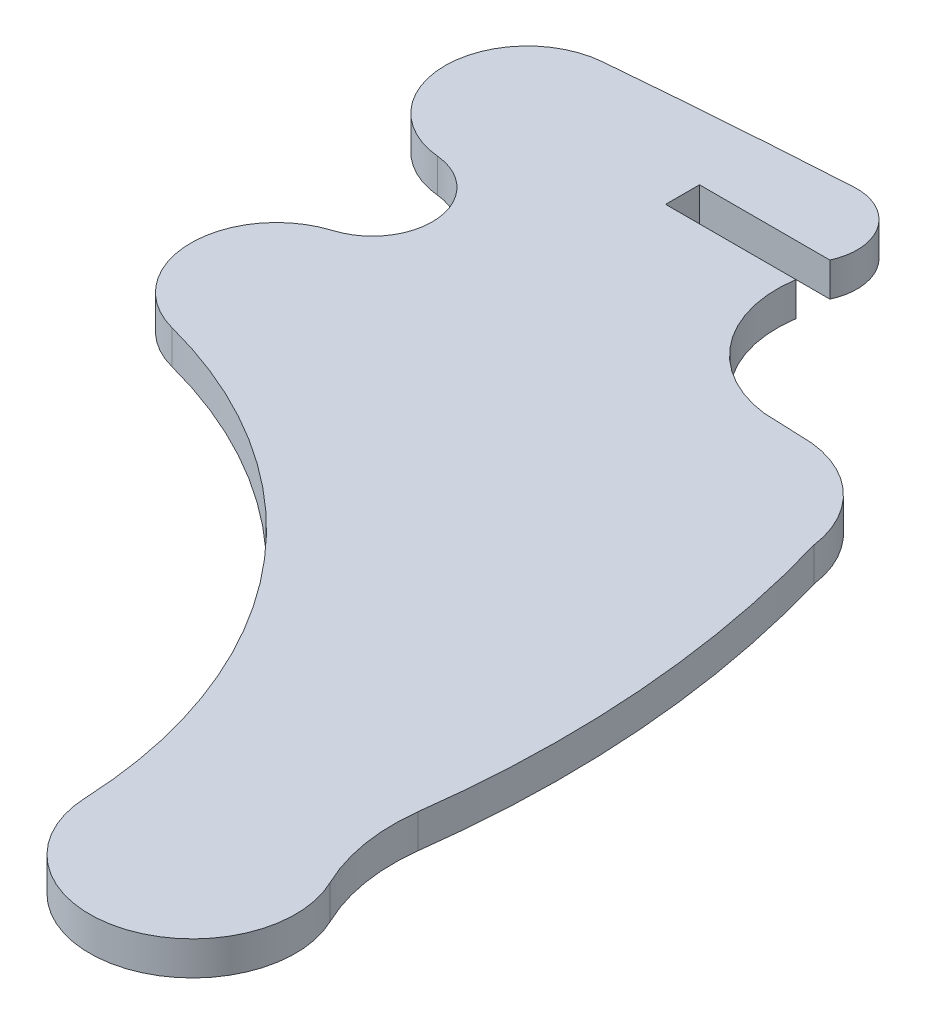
ISO-10303-21;
HEADER;
FILE_DESCRIPTION(('STEP AP214'),'2;1');
FILE_NAME('part.step','',(''),(''),'','','');
FILE_SCHEMA(('AUTOMOTIVE_DESIGN { 1 0 10303 214 1 1 1 1 }'));
ENDSEC;
DATA;
#1=APPLICATION_CONTEXT('core data for automotive mechanical design processes');
#2=APPLICATION_PROTOCOL_DEFINITION('international standard','automotive_design',2000,#1);
#3=PRODUCT_CONTEXT('',#1,'mechanical');
#4=PRODUCT('Part','Part','',(#3));
#5=PRODUCT_RELATED_PRODUCT_CATEGORY('part','',(#4));
#6=PRODUCT_DEFINITION_FORMATION('','',#4);
#7=PRODUCT_DEFINITION_CONTEXT('part definition',#1,'design');
#8=PRODUCT_DEFINITION('design','',#6,#7);
#9=PRODUCT_DEFINITION_SHAPE('','',#8);
#10=(LENGTH_UNIT() NAMED_UNIT(*) SI_UNIT(.MILLI.,.METRE.));
#11=(NAMED_UNIT(*) PLANE_ANGLE_UNIT() SI_UNIT($,.RADIAN.));
#12=(NAMED_UNIT(*) SI_UNIT($,.STERADIAN.) SOLID_ANGLE_UNIT());
#13=UNCERTAINTY_MEASURE_WITH_UNIT(LENGTH_MEASURE(1.E-05),#10,'distance_accuracy_value','');
#14=(GEOMETRIC_REPRESENTATION_CONTEXT(3) GLOBAL_UNCERTAINTY_ASSIGNED_CONTEXT((#13)) GLOBAL_UNIT_ASSIGNED_CONTEXT((#10,
#11,#12)) REPRESENTATION_CONTEXT('',''));
#15=CARTESIAN_POINT('',(0.,0.,0.));
#16=DIRECTION('',(0.,0.,1.));
#17=DIRECTION('',(1.,0.,0.));
#18=AXIS2_PLACEMENT_3D('',#15,#16,#17);
#19=CARTESIAN_POINT('',(-42007.813564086,3.,-18403.2242232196));
#20=DIRECTION('',(0.,-1.,0.));
#21=DIRECTION('',(0.,0.,-1.));
#22=AXIS2_PLACEMENT_3D('',#19,#20,#21);
#23=CYLINDRICAL_SURFACE('',#22,4.69313285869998);
#24=CARTESIAN_POINT('',(-42007.813564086,0.,-18403.2242232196));
#25=DIRECTION('',(0.,1.,0.));
#26=DIRECTION('',(0.,0.,1.));
#27=AXIS2_PLACEMENT_3D('',#24,#25,#26);
#28=CIRCLE('',#27,4.69313285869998);
#29=CARTESIAN_POINT('',(-42003.558594,0.,-18401.244141));
#30=VERTEX_POINT('',#29);
#31=CARTESIAN_POINT('',(-42008.085483,0.,-18407.9094719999));
#32=VERTEX_POINT('',#31);
#33=EDGE_CURVE('E174',#30,#32,#28,.T.);
#34=ORIENTED_EDGE('',*,*,#33,.T.);
#35=DIRECTION('',(0.,-1.,0.));
#36=VECTOR('',#35,1.);
#37=CARTESIAN_POINT('',(-42008.085483,3.,-18407.9094719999));
#38=LINE('',#37,#36);
#39=CARTESIAN_POINT('',(-42008.085483,3.,-18407.9094719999));
#40=VERTEX_POINT('',#39);
#41=EDGE_CURVE('E11',#40,#32,#38,.T.);
#42=ORIENTED_EDGE('',*,*,#41,.F.);
#43=CARTESIAN_POINT('',(-42007.813564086,3.,-18403.2242232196));
#44=DIRECTION('',(0.,1.,0.));
#45=DIRECTION('',(0.,0.,1.));
#46=AXIS2_PLACEMENT_3D('',#43,#44,#45);
#47=CIRCLE('',#46,4.69313285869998);
#48=CARTESIAN_POINT('',(-42003.558594,3.,-18401.244141));
#49=VERTEX_POINT('',#48);
#50=EDGE_CURVE('E202',#49,#40,#47,.T.);
#51=ORIENTED_EDGE('',*,*,#50,.F.);
#52=DIRECTION('',(0.,-1.,0.));
#53=VECTOR('',#52,1.);
#54=CARTESIAN_POINT('',(-42003.558594,3.,-18401.244141));
#55=LINE('',#54,#53);
#56=EDGE_CURVE('E170',#49,#30,#55,.T.);
#57=ORIENTED_EDGE('',*,*,#56,.T.);
#58=EDGE_LOOP('',(#34,#42,#51,#57));
#59=FACE_BOUND('',#58,.T.);
#60=ADVANCED_FACE('F36',(#59),#23,.T.);
#61=CARTESIAN_POINT('',(-41969.777339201,3.,-17743.9472663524));
#62=DIRECTION('',(0.,-1.,0.));
#63=DIRECTION('',(0.,0.,-1.));
#64=AXIS2_PLACEMENT_3D('',#61,#62,#63);
#65=CYLINDRICAL_SURFACE('',#64,665.066406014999);
#66=CARTESIAN_POINT('',(-41969.777339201,0.,-17743.9472663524));
#67=DIRECTION('',(0.,1.,0.));
#68=DIRECTION('',(0.,0.,1.));
#69=AXIS2_PLACEMENT_3D('',#66,#67,#68);
#70=CIRCLE('',#69,665.066406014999);
#71=CARTESIAN_POINT('',(-42028.8619710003,0.,-18406.383928));
#72=VERTEX_POINT('',#71);
#73=EDGE_CURVE('E177',#32,#72,#70,.T.);
#74=ORIENTED_EDGE('',*,*,#73,.T.);
#75=DIRECTION('',(0.,-1.,0.));
#76=VECTOR('',#75,1.);
#77=CARTESIAN_POINT('',(-42028.8619710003,3.,-18406.383928));
#78=LINE('',#77,#76);
#79=CARTESIAN_POINT('',(-42028.8619710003,3.,-18406.383928));
#80=VERTEX_POINT('',#79);
#81=EDGE_CURVE('E44',#80,#72,#78,.T.);
#82=ORIENTED_EDGE('',*,*,#81,.F.);
#83=CARTESIAN_POINT('',(-41969.777339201,3.,-17743.9472663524));
#84=DIRECTION('',(0.,1.,0.));
#85=DIRECTION('',(0.,0.,1.));
#86=AXIS2_PLACEMENT_3D('',#83,#84,#85);
#87=CIRCLE('',#86,665.066406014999);
#88=EDGE_CURVE('E116',#40,#80,#87,.T.);
#89=ORIENTED_EDGE('',*,*,#88,.F.);
#90=ORIENTED_EDGE('',*,*,#41,.T.);
#91=EDGE_LOOP('',(#74,#82,#89,#90));
#92=FACE_BOUND('',#91,.T.);
#93=ADVANCED_FACE('F295',(#92),#65,.T.);
#94=CARTESIAN_POINT('',(-42028.2148416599,3.,-18399.1082920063));
#95=DIRECTION('',(0.,-1.,0.));
#96=DIRECTION('',(0.,0.,-1.));
#97=AXIS2_PLACEMENT_3D('',#94,#95,#96);
#98=CYLINDRICAL_SURFACE('',#97,7.30435866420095);
#99=CARTESIAN_POINT('',(-42028.2148416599,0.,-18399.1082920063));
#100=DIRECTION('',(0.,1.,0.));
#101=DIRECTION('',(0.,0.,1.));
#102=AXIS2_PLACEMENT_3D('',#99,#100,#101);
#103=CIRCLE('',#102,7.30435866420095);
#104=CARTESIAN_POINT('',(-42028.9011059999,0.,-18391.836243));
#105=VERTEX_POINT('',#104);
#106=EDGE_CURVE('E179',#72,#105,#103,.T.);
#107=ORIENTED_EDGE('',*,*,#106,.T.);
#108=DIRECTION('',(0.,-1.,0.));
#109=VECTOR('',#108,1.);
#110=CARTESIAN_POINT('',(-42028.9011059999,3.,-18391.836243));
#111=LINE('',#110,#109);
#112=CARTESIAN_POINT('',(-42028.9011059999,3.,-18391.836243));
#113=VERTEX_POINT('',#112);
#114=EDGE_CURVE('E230',#113,#105,#111,.T.);
#115=ORIENTED_EDGE('',*,*,#114,.F.);
#116=CARTESIAN_POINT('',(-42028.2148416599,3.,-18399.1082920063));
#117=DIRECTION('',(0.,1.,0.));
#118=DIRECTION('',(0.,0.,1.));
#119=AXIS2_PLACEMENT_3D('',#116,#117,#118);
#120=CIRCLE('',#119,7.30435866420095);
#121=EDGE_CURVE('E238',#80,#113,#120,.T.);
#122=ORIENTED_EDGE('',*,*,#121,.F.);
#123=ORIENTED_EDGE('',*,*,#81,.T.);
#124=EDGE_LOOP('',(#107,#115,#122,#123));
#125=FACE_BOUND('',#124,.T.);
#126=ADVANCED_FACE('F236',(#125),#98,.T.);
#127=CARTESIAN_POINT('',(-42029.3984280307,3.,-18386.5585073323));
#128=DIRECTION('',(0.,-1.,0.));
#129=DIRECTION('',(0.,0.,-1.));
#130=AXIS2_PLACEMENT_3D('',#127,#128,#129);
#131=CYLINDRICAL_SURFACE('',#130,5.30111525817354);
#132=CARTESIAN_POINT('',(-42029.3984280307,0.,-18386.5585073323));
#133=DIRECTION('',(0.,-1.,0.));
#134=DIRECTION('',(0.,0.,1.));
#135=AXIS2_PLACEMENT_3D('',#132,#133,#134);
#136=CIRCLE('',#135,5.30111525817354);
#137=CARTESIAN_POINT('',(-42027.830825,0.,-18381.494473));
#138=VERTEX_POINT('',#137);
#139=EDGE_CURVE('E181',#105,#138,#136,.T.);
#140=ORIENTED_EDGE('',*,*,#139,.T.);
#141=DIRECTION('',(0.,-1.,0.));
#142=VECTOR('',#141,1.);
#143=CARTESIAN_POINT('',(-42027.830825,3.,-18381.494473));
#144=LINE('',#143,#142);
#145=CARTESIAN_POINT('',(-42027.830825,3.,-18381.494473));
#146=VERTEX_POINT('',#145);
#147=EDGE_CURVE('E227',#146,#138,#144,.T.);
#148=ORIENTED_EDGE('',*,*,#147,.F.);
#149=CARTESIAN_POINT('',(-42029.3984280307,3.,-18386.5585073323));
#150=DIRECTION('',(0.,-1.,0.));
#151=DIRECTION('',(0.,0.,1.));
#152=AXIS2_PLACEMENT_3D('',#149,#150,#151);
#153=CIRCLE('',#152,5.30111525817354);
#154=EDGE_CURVE('E256',#113,#146,#153,.T.);
#155=ORIENTED_EDGE('',*,*,#154,.F.);
#156=ORIENTED_EDGE('',*,*,#114,.T.);
#157=EDGE_LOOP('',(#140,#148,#155,#156));
#158=FACE_BOUND('',#157,.T.);
#159=ADVANCED_FACE('F247',(#158),#131,.F.);
#160=CARTESIAN_POINT('',(-42025.5898252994,3.,-18374.2511101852));
#161=DIRECTION('',(0.,-1.,0.));
#162=DIRECTION('',(0.,0.,-1.));
#163=AXIS2_PLACEMENT_3D('',#160,#161,#162);
#164=CYLINDRICAL_SURFACE('',#163,7.5821095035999);
#165=CARTESIAN_POINT('',(-42025.5898252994,0.,-18374.2511101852));
#166=DIRECTION('',(0.,1.,0.));
#167=DIRECTION('',(0.,0.,1.));
#168=AXIS2_PLACEMENT_3D('',#165,#166,#167);
#169=CIRCLE('',#168,7.5821095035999);
#170=CARTESIAN_POINT('',(-42027.507342,0.,-18366.915477));
#171=VERTEX_POINT('',#170);
#172=EDGE_CURVE('E183',#138,#171,#169,.T.);
#173=ORIENTED_EDGE('',*,*,#172,.T.);
#174=DIRECTION('',(0.,-1.,0.));
#175=VECTOR('',#174,1.);
#176=CARTESIAN_POINT('',(-42027.507342,3.,-18366.915477));
#177=LINE('',#176,#175);
#178=CARTESIAN_POINT('',(-42027.507342,3.,-18366.915477));
#179=VERTEX_POINT('',#178);
#180=EDGE_CURVE('E224',#179,#171,#177,.T.);
#181=ORIENTED_EDGE('',*,*,#180,.F.);
#182=CARTESIAN_POINT('',(-42025.5898252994,3.,-18374.2511101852));
#183=DIRECTION('',(0.,1.,0.));
#184=DIRECTION('',(0.,0.,1.));
#185=AXIS2_PLACEMENT_3D('',#182,#183,#184);
#186=CIRCLE('',#185,7.5821095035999);
#187=EDGE_CURVE('E253',#146,#179,#186,.T.);
#188=ORIENTED_EDGE('',*,*,#187,.F.);
#189=ORIENTED_EDGE('',*,*,#147,.T.);
#190=EDGE_LOOP('',(#173,#181,#188,#189));
#191=FACE_BOUND('',#190,.T.);
#192=ADVANCED_FACE('F251',(#191),#164,.T.);
#193=CARTESIAN_POINT('',(-42038.4345437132,3.,-18325.114457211));
#194=DIRECTION('',(0.,-1.,0.));
#195=DIRECTION('',(0.,0.,-1.));
#196=AXIS2_PLACEMENT_3D('',#193,#194,#195);
#197=CYLINDRICAL_SURFACE('',#196,43.2056592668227);
#198=CARTESIAN_POINT('',(-42038.4345437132,0.,-18325.114457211));
#199=DIRECTION('',(0.,-1.,0.));
#200=DIRECTION('',(0.,0.,1.));
#201=AXIS2_PLACEMENT_3D('',#198,#199,#200);
#202=CIRCLE('',#201,43.2056592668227);
#203=CARTESIAN_POINT('',(-41995.269582,0.,-18326.98931));
#204=VERTEX_POINT('',#203);
#205=EDGE_CURVE('E185',#171,#204,#202,.T.);
#206=ORIENTED_EDGE('',*,*,#205,.T.);
#207=DIRECTION('',(0.,-1.,0.));
#208=VECTOR('',#207,1.);
#209=CARTESIAN_POINT('',(-41995.269582,3.,-18326.98931));
#210=LINE('',#209,#208);
#211=CARTESIAN_POINT('',(-41995.269582,3.,-18326.98931));
#212=VERTEX_POINT('',#211);
#213=EDGE_CURVE('E221',#212,#204,#210,.T.);
#214=ORIENTED_EDGE('',*,*,#213,.F.);
#215=CARTESIAN_POINT('',(-42038.4345437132,3.,-18325.114457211));
#216=DIRECTION('',(0.,-1.,0.));
#217=DIRECTION('',(0.,0.,1.));
#218=AXIS2_PLACEMENT_3D('',#215,#216,#217);
#219=CIRCLE('',#218,43.2056592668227);
#220=EDGE_CURVE('E255',#179,#212,#219,.T.);
#221=ORIENTED_EDGE('',*,*,#220,.F.);
#222=ORIENTED_EDGE('',*,*,#180,.T.);
#223=EDGE_LOOP('',(#206,#214,#221,#222));
#224=FACE_BOUND('',#223,.T.);
#225=ADVANCED_FACE('F308',(#224),#197,.F.);
#226=CARTESIAN_POINT('',(-41986.1528680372,3.,-18327.3865868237));
#227=DIRECTION('',(0.,-1.,0.));
#228=DIRECTION('',(0.,0.,-1.));
#229=AXIS2_PLACEMENT_3D('',#226,#227,#228);
#230=CYLINDRICAL_SURFACE('',#229,9.12536587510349);
#231=CARTESIAN_POINT('',(-41986.1528680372,0.,-18327.3865868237));
#232=DIRECTION('',(0.,1.,0.));
#233=DIRECTION('',(0.,0.,1.));
#234=AXIS2_PLACEMENT_3D('',#231,#232,#233);
#235=CIRCLE('',#234,9.12536587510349);
#236=CARTESIAN_POINT('',(-41977.938337,0.,-18331.3607259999));
#237=VERTEX_POINT('',#236);
#238=EDGE_CURVE('E187',#204,#237,#235,.T.);
#239=ORIENTED_EDGE('',*,*,#238,.T.);
#240=DIRECTION('',(0.,-1.,0.));
#241=VECTOR('',#240,1.);
#242=CARTESIAN_POINT('',(-41977.938337,3.,-18331.3607259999));
#243=LINE('',#242,#241);
#244=CARTESIAN_POINT('',(-41977.938337,3.,-18331.3607259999));
#245=VERTEX_POINT('',#244);
#246=EDGE_CURVE('E218',#245,#237,#243,.T.);
#247=ORIENTED_EDGE('',*,*,#246,.F.);
#248=CARTESIAN_POINT('',(-41986.1528680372,3.,-18327.3865868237));
#249=DIRECTION('',(0.,1.,0.));
#250=DIRECTION('',(0.,0.,1.));
#251=AXIS2_PLACEMENT_3D('',#248,#249,#250);
#252=CIRCLE('',#251,9.12536587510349);
#253=EDGE_CURVE('E258',#212,#245,#252,.T.);
#254=ORIENTED_EDGE('',*,*,#253,.F.);
#255=ORIENTED_EDGE('',*,*,#213,.T.);
#256=EDGE_LOOP('',(#239,#247,#254,#255));
#257=FACE_BOUND('',#256,.T.);
#258=ADVANCED_FACE('F311',(#257),#230,.T.);
#259=CARTESIAN_POINT('',(-41962.9175374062,3.,-18338.6223828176));
#260=DIRECTION('',(0.,-1.,0.));
#261=DIRECTION('',(0.,0.,-1.));
#262=AXIS2_PLACEMENT_3D('',#259,#260,#261);
#263=CYLINDRICAL_SURFACE('',#262,16.6840067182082);
#264=CARTESIAN_POINT('',(-41962.9175374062,0.,-18338.6223828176));
#265=DIRECTION('',(0.,-1.,0.));
#266=DIRECTION('',(0.,0.,1.));
#267=AXIS2_PLACEMENT_3D('',#264,#265,#266);
#268=CIRCLE('',#267,16.6840067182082);
#269=CARTESIAN_POINT('',(-41979.474598,0.,-18340.676604));
#270=VERTEX_POINT('',#269);
#271=EDGE_CURVE('E189',#237,#270,#268,.T.);
#272=ORIENTED_EDGE('',*,*,#271,.T.);
#273=DIRECTION('',(0.,-1.,0.));
#274=VECTOR('',#273,1.);
#275=CARTESIAN_POINT('',(-41979.474598,3.,-18340.676604));
#276=LINE('',#275,#274);
#277=CARTESIAN_POINT('',(-41979.474598,3.,-18340.676604));
#278=VERTEX_POINT('',#277);
#279=EDGE_CURVE('E215',#278,#270,#276,.T.);
#280=ORIENTED_EDGE('',*,*,#279,.F.);
#281=CARTESIAN_POINT('',(-41962.9175374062,3.,-18338.6223828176));
#282=DIRECTION('',(0.,-1.,0.));
#283=DIRECTION('',(0.,0.,1.));
#284=AXIS2_PLACEMENT_3D('',#281,#282,#283);
#285=CIRCLE('',#284,16.6840067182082);
#286=EDGE_CURVE('E264',#245,#278,#285,.T.);
#287=ORIENTED_EDGE('',*,*,#286,.F.);
#288=ORIENTED_EDGE('',*,*,#246,.T.);
#289=EDGE_LOOP('',(#272,#280,#287,#288));
#290=FACE_BOUND('',#289,.T.);
#291=ADVANCED_FACE('F315',(#290),#263,.F.);
#292=CARTESIAN_POINT('',(-42071.0276520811,3.,-18352.742278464));
#293=DIRECTION('',(0.,-1.,0.));
#294=DIRECTION('',(0.,0.,-1.));
#295=AXIS2_PLACEMENT_3D('',#292,#293,#294);
#296=CYLINDRICAL_SURFACE('',#295,92.3446923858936);
#297=CARTESIAN_POINT('',(-42071.0276520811,0.,-18352.742278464));
#298=DIRECTION('',(0.,1.,0.));
#299=DIRECTION('',(0.,0.,1.));
#300=AXIS2_PLACEMENT_3D('',#297,#298,#299);
#301=CIRCLE('',#300,92.3446923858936);
#302=CARTESIAN_POINT('',(-41982.404563,0.,-18378.69397));
#303=VERTEX_POINT('',#302);
#304=EDGE_CURVE('E191',#270,#303,#301,.T.);
#305=ORIENTED_EDGE('',*,*,#304,.T.);
#306=DIRECTION('',(0.,-1.,0.));
#307=VECTOR('',#306,1.);
#308=CARTESIAN_POINT('',(-41982.404563,3.,-18378.69397));
#309=LINE('',#308,#307);
#310=CARTESIAN_POINT('',(-41982.404563,3.,-18378.69397));
#311=VERTEX_POINT('',#310);
#312=EDGE_CURVE('E212',#311,#303,#309,.T.);
#313=ORIENTED_EDGE('',*,*,#312,.F.);
#314=CARTESIAN_POINT('',(-42071.0276520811,3.,-18352.742278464));
#315=DIRECTION('',(0.,1.,0.));
#316=DIRECTION('',(0.,0.,1.));
#317=AXIS2_PLACEMENT_3D('',#314,#315,#316);
#318=CIRCLE('',#317,92.3446923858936);
#319=EDGE_CURVE('E266',#278,#311,#318,.T.);
#320=ORIENTED_EDGE('',*,*,#319,.F.);
#321=ORIENTED_EDGE('',*,*,#279,.T.);
#322=EDGE_LOOP('',(#305,#313,#320,#321));
#323=FACE_BOUND('',#322,.T.);
#324=ADVANCED_FACE('F319',(#323),#296,.T.);
#325=CARTESIAN_POINT('',(-41991.2544485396,3.,-18377.5240791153));
#326=DIRECTION('',(0.,-1.,0.));
#327=DIRECTION('',(0.,0.,-1.));
#328=AXIS2_PLACEMENT_3D('',#325,#326,#327);
#329=CYLINDRICAL_SURFACE('',#328,8.92687620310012);
#330=CARTESIAN_POINT('',(-41991.2544485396,0.,-18377.5240791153));
#331=DIRECTION('',(0.,1.,0.));
#332=DIRECTION('',(0.,0.,1.));
#333=AXIS2_PLACEMENT_3D('',#330,#331,#332);
#334=CIRCLE('',#333,8.92687620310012);
#335=CARTESIAN_POINT('',(-41990.348245,0.,-18386.40484));
#336=VERTEX_POINT('',#335);
#337=EDGE_CURVE('E193',#303,#336,#334,.T.);
#338=ORIENTED_EDGE('',*,*,#337,.T.);
#339=DIRECTION('',(0.,-1.,0.));
#340=VECTOR('',#339,1.);
#341=CARTESIAN_POINT('',(-41990.348245,3.,-18386.40484));
#342=LINE('',#341,#340);
#343=CARTESIAN_POINT('',(-41990.348245,3.,-18386.40484));
#344=VERTEX_POINT('',#343);
#345=EDGE_CURVE('E209',#344,#336,#342,.T.);
#346=ORIENTED_EDGE('',*,*,#345,.F.);
#347=CARTESIAN_POINT('',(-41991.2544485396,3.,-18377.5240791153));
#348=DIRECTION('',(0.,1.,0.));
#349=DIRECTION('',(0.,0.,1.));
#350=AXIS2_PLACEMENT_3D('',#347,#348,#349);
#351=CIRCLE('',#350,8.92687620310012);
#352=EDGE_CURVE('E268',#311,#344,#351,.T.);
#353=ORIENTED_EDGE('',*,*,#352,.F.);
#354=ORIENTED_EDGE('',*,*,#312,.T.);
#355=EDGE_LOOP('',(#338,#346,#353,#354));
#356=FACE_BOUND('',#355,.T.);
#357=ADVANCED_FACE('F323',(#356),#329,.T.);
#358=CARTESIAN_POINT('',(-41990.348245,3.,-18386.40484));
#359=DIRECTION('',(-0.04050917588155,0.,0.999179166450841));
#360=DIRECTION('',(0.999179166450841,0.,0.04050917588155));
#361=AXIS2_PLACEMENT_3D('',#358,#359,#360);
#362=PLANE('',#361);
#363=DIRECTION('',(-0.999179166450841,0.,-0.04050917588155));
#364=VECTOR('',#363,1.);
#365=CARTESIAN_POINT('',(-41990.348245,0.,-18386.40484));
#366=LINE('',#365,#364);
#367=CARTESIAN_POINT('',(-41994.71875,0.,-18386.582031));
#368=VERTEX_POINT('',#367);
#369=EDGE_CURVE('E195',#336,#368,#366,.T.);
#370=ORIENTED_EDGE('',*,*,#369,.T.);
#371=DIRECTION('',(0.,-1.,0.));
#372=VECTOR('',#371,1.);
#373=CARTESIAN_POINT('',(-41994.71875,3.,-18386.582031));
#374=LINE('',#373,#372);
#375=CARTESIAN_POINT('',(-41994.71875,3.,-18386.582031));
#376=VERTEX_POINT('',#375);
#377=EDGE_CURVE('E206',#376,#368,#374,.T.);
#378=ORIENTED_EDGE('',*,*,#377,.F.);
#379=DIRECTION('',(-0.999179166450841,0.,-0.04050917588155));
#380=VECTOR('',#379,1.);
#381=CARTESIAN_POINT('',(-41990.348245,3.,-18386.40484));
#382=LINE('',#381,#380);
#383=EDGE_CURVE('E270',#344,#376,#382,.T.);
#384=ORIENTED_EDGE('',*,*,#383,.F.);
#385=ORIENTED_EDGE('',*,*,#345,.T.);
#386=EDGE_LOOP('',(#370,#378,#384,#385));
#387=FACE_BOUND('',#386,.T.);
#388=ADVANCED_FACE('F276',(#387),#362,.F.);
#389=CARTESIAN_POINT('',(-41993.4964562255,3.,-18396.6899308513));
#390=DIRECTION('',(0.,-1.,0.));
#391=DIRECTION('',(0.,0.,-1.));
#392=AXIS2_PLACEMENT_3D('',#389,#390,#391);
#393=CYLINDRICAL_SURFACE('',#392,10.1815343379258);
#394=CARTESIAN_POINT('',(-41993.4964562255,0.,-18396.6899308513));
#395=DIRECTION('',(0.,-1.,0.));
#396=DIRECTION('',(0.,0.,1.));
#397=AXIS2_PLACEMENT_3D('',#394,#395,#396);
#398=CIRCLE('',#397,10.1815343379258);
#399=CARTESIAN_POINT('',(-42003.558719,0.,-18398.2438));
#400=VERTEX_POINT('',#399);
#401=EDGE_CURVE('E197',#368,#400,#398,.T.);
#402=ORIENTED_EDGE('',*,*,#401,.T.);
#403=DIRECTION('',(0.,-1.,0.));
#404=VECTOR('',#403,1.);
#405=CARTESIAN_POINT('',(-42003.558719,3.,-18398.2438));
#406=LINE('',#405,#404);
#407=CARTESIAN_POINT('',(-42003.558719,3.,-18398.2438));
#408=VERTEX_POINT('',#407);
#409=EDGE_CURVE('E165',#408,#400,#406,.T.);
#410=ORIENTED_EDGE('',*,*,#409,.F.);
#411=CARTESIAN_POINT('',(-41993.4964562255,3.,-18396.6899308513));
#412=DIRECTION('',(0.,-1.,0.));
#413=DIRECTION('',(0.,0.,1.));
#414=AXIS2_PLACEMENT_3D('',#411,#412,#413);
#415=CIRCLE('',#414,10.1815343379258);
#416=EDGE_CURVE('E156',#376,#408,#415,.T.);
#417=ORIENTED_EDGE('',*,*,#416,.F.);
#418=ORIENTED_EDGE('',*,*,#377,.T.);
#419=EDGE_LOOP('',(#402,#410,#417,#418));
#420=FACE_BOUND('',#419,.T.);
#421=ADVANCED_FACE('F280',(#420),#393,.F.);
#422=CARTESIAN_POINT('',(-42003.558719,3.,-18398.2438));
#423=DIRECTION('',(0.000139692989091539,0.,0.999999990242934));
#424=DIRECTION('',(0.999999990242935,0.,-0.000139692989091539));
#425=AXIS2_PLACEMENT_3D('',#422,#423,#424);
#426=PLANE('',#425);
#427=DIRECTION('',(-0.999999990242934,0.,0.000139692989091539));
#428=VECTOR('',#427,1.);
#429=CARTESIAN_POINT('',(-42003.558719,0.,-18398.2438));
#430=LINE('',#429,#428);
#431=CARTESIAN_POINT('',(-42015.105469,0.,-18398.242187));
#432=VERTEX_POINT('',#431);
#433=EDGE_CURVE('E164',#400,#432,#430,.T.);
#434=ORIENTED_EDGE('',*,*,#433,.T.);
#435=DIRECTION('',(0.,-1.,0.));
#436=VECTOR('',#435,1.);
#437=CARTESIAN_POINT('',(-42015.105469,3.,-18398.242187));
#438=LINE('',#437,#436);
#439=CARTESIAN_POINT('',(-42015.105469,3.,-18398.242187));
#440=VERTEX_POINT('',#439);
#441=EDGE_CURVE('E161',#440,#432,#438,.T.);
#442=ORIENTED_EDGE('',*,*,#441,.F.);
#443=DIRECTION('',(-0.999999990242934,0.,0.000139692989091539));
#444=VECTOR('',#443,1.);
#445=CARTESIAN_POINT('',(-42003.558719,3.,-18398.2438));
#446=LINE('',#445,#444);
#447=EDGE_CURVE('E150',#408,#440,#446,.T.);
#448=ORIENTED_EDGE('',*,*,#447,.F.);
#449=ORIENTED_EDGE('',*,*,#409,.T.);
#450=EDGE_LOOP('',(#434,#442,#448,#449));
#451=FACE_BOUND('',#450,.T.);
#452=ADVANCED_FACE('F162',(#451),#426,.F.);
#453=CARTESIAN_POINT('',(-42015.105469,3.,-18398.242187));
#454=DIRECTION('',(-1.,0.,0.));
#455=DIRECTION('',(0.,0.,1.));
#456=AXIS2_PLACEMENT_3D('',#453,#454,#455);
#457=PLANE('',#456);
#458=DIRECTION('',(0.,0.,-1.));
#459=VECTOR('',#458,1.);
#460=CARTESIAN_POINT('',(-42015.105469,0.,-18398.242187));
#461=LINE('',#460,#459);
#462=CARTESIAN_POINT('',(-42015.105469,0.,-18401.244141));
#463=VERTEX_POINT('',#462);
#464=EDGE_CURVE('E102',#432,#463,#461,.T.);
#465=ORIENTED_EDGE('',*,*,#464,.T.);
#466=DIRECTION('',(0.,-1.,0.));
#467=VECTOR('',#466,1.);
#468=CARTESIAN_POINT('',(-42015.105469,3.,-18401.244141));
#469=LINE('',#468,#467);
#470=CARTESIAN_POINT('',(-42015.105469,3.,-18401.244141));
#471=VERTEX_POINT('',#470);
#472=EDGE_CURVE('E166',#471,#463,#469,.T.);
#473=ORIENTED_EDGE('',*,*,#472,.F.);
#474=DIRECTION('',(0.,0.,-1.));
#475=VECTOR('',#474,1.);
#476=CARTESIAN_POINT('',(-42015.105469,3.,-18398.242187));
#477=LINE('',#476,#475);
#478=EDGE_CURVE('E154',#440,#471,#477,.T.);
#479=ORIENTED_EDGE('',*,*,#478,.F.);
#480=ORIENTED_EDGE('',*,*,#441,.T.);
#481=EDGE_LOOP('',(#465,#473,#479,#480));
#482=FACE_BOUND('',#481,.T.);
#483=ADVANCED_FACE('F168',(#482),#457,.F.);
#484=CARTESIAN_POINT('',(-42015.105469,3.,-18401.244141));
#485=DIRECTION('',(0.,0.,-1.));
#486=DIRECTION('',(-1.,0.,0.));
#487=AXIS2_PLACEMENT_3D('',#484,#485,#486);
#488=PLANE('',#487);
#489=DIRECTION('',(1.,0.,0.));
#490=VECTOR('',#489,1.);
#491=CARTESIAN_POINT('',(-42015.105469,0.,-18401.244141));
#492=LINE('',#491,#490);
#493=EDGE_CURVE('E108',#463,#30,#492,.T.);
#494=ORIENTED_EDGE('',*,*,#493,.T.);
#495=ORIENTED_EDGE('',*,*,#56,.F.);
#496=DIRECTION('',(1.,0.,0.));
#497=VECTOR('',#496,1.);
#498=CARTESIAN_POINT('',(-42015.105469,3.,-18401.244141));
#499=LINE('',#498,#497);
#500=EDGE_CURVE('E52',#471,#49,#499,.T.);
#501=ORIENTED_EDGE('',*,*,#500,.F.);
#502=ORIENTED_EDGE('',*,*,#472,.T.);
#503=EDGE_LOOP('',(#494,#495,#501,#502));
#504=FACE_BOUND('',#503,.T.);
#505=ADVANCED_FACE('F284',(#504),#488,.F.);
#506=CARTESIAN_POINT('',(-42007.813564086,3.,-18403.2242232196));
#507=DIRECTION('',(0.,1.,0.));
#508=DIRECTION('',(0.,0.,1.));
#509=AXIS2_PLACEMENT_3D('',#506,#507,#508);
#510=PLANE('',#509);
#511=ORIENTED_EDGE('',*,*,#50,.T.);
#512=ORIENTED_EDGE('',*,*,#88,.T.);
#513=ORIENTED_EDGE('',*,*,#121,.T.);
#514=ORIENTED_EDGE('',*,*,#154,.T.);
#515=ORIENTED_EDGE('',*,*,#187,.T.);
#516=ORIENTED_EDGE('',*,*,#220,.T.);
#517=ORIENTED_EDGE('',*,*,#253,.T.);
#518=ORIENTED_EDGE('',*,*,#286,.T.);
#519=ORIENTED_EDGE('',*,*,#319,.T.);
#520=ORIENTED_EDGE('',*,*,#352,.T.);
#521=ORIENTED_EDGE('',*,*,#383,.T.);
#522=ORIENTED_EDGE('',*,*,#416,.T.);
#523=ORIENTED_EDGE('',*,*,#447,.T.);
#524=ORIENTED_EDGE('',*,*,#478,.T.);
#525=ORIENTED_EDGE('',*,*,#500,.T.);
#526=EDGE_LOOP('',(#511,#512,#513,#514,#515,#516,#517,#518,#519,#520,#521,#522,#523,#524,#525));
#527=FACE_BOUND('',#526,.T.);
#528=ADVANCED_FACE('F152',(#527),#510,.T.);
#529=CARTESIAN_POINT('',(-42007.813564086,0.,-18403.2242232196));
#530=DIRECTION('',(0.,1.,0.));
#531=DIRECTION('',(0.,0.,1.));
#532=AXIS2_PLACEMENT_3D('',#529,#530,#531);
#533=PLANE('',#532);
#534=ORIENTED_EDGE('',*,*,#33,.F.);
#535=ORIENTED_EDGE('',*,*,#493,.F.);
#536=ORIENTED_EDGE('',*,*,#464,.F.);
#537=ORIENTED_EDGE('',*,*,#433,.F.);
#538=ORIENTED_EDGE('',*,*,#401,.F.);
#539=ORIENTED_EDGE('',*,*,#369,.F.);
#540=ORIENTED_EDGE('',*,*,#337,.F.);
#541=ORIENTED_EDGE('',*,*,#304,.F.);
#542=ORIENTED_EDGE('',*,*,#271,.F.);
#543=ORIENTED_EDGE('',*,*,#238,.F.);
#544=ORIENTED_EDGE('',*,*,#205,.F.);
#545=ORIENTED_EDGE('',*,*,#172,.F.);
#546=ORIENTED_EDGE('',*,*,#139,.F.);
#547=ORIENTED_EDGE('',*,*,#106,.F.);
#548=ORIENTED_EDGE('',*,*,#73,.F.);
#549=EDGE_LOOP('',(#534,#535,#536,#537,#538,#539,#540,#541,#542,#543,#544,#545,#546,#547,#548));
#550=FACE_BOUND('',#549,.T.);
#551=ADVANCED_FACE('F242',(#550),#533,.F.);
#552=CLOSED_SHELL('',(#60,#93,#126,#159,#192,#225,#258,#291,#324,#357,#388,#421,#452,#483,#505,
#528,#551));
#553=MANIFOLD_SOLID_BREP('B2',#552);
#554=ADVANCED_BREP_SHAPE_REPRESENTATION('',(#18,#553),#14);
#555=SHAPE_DEFINITION_REPRESENTATION(#9,#554);
ENDSEC;
END-ISO-10303-21;
